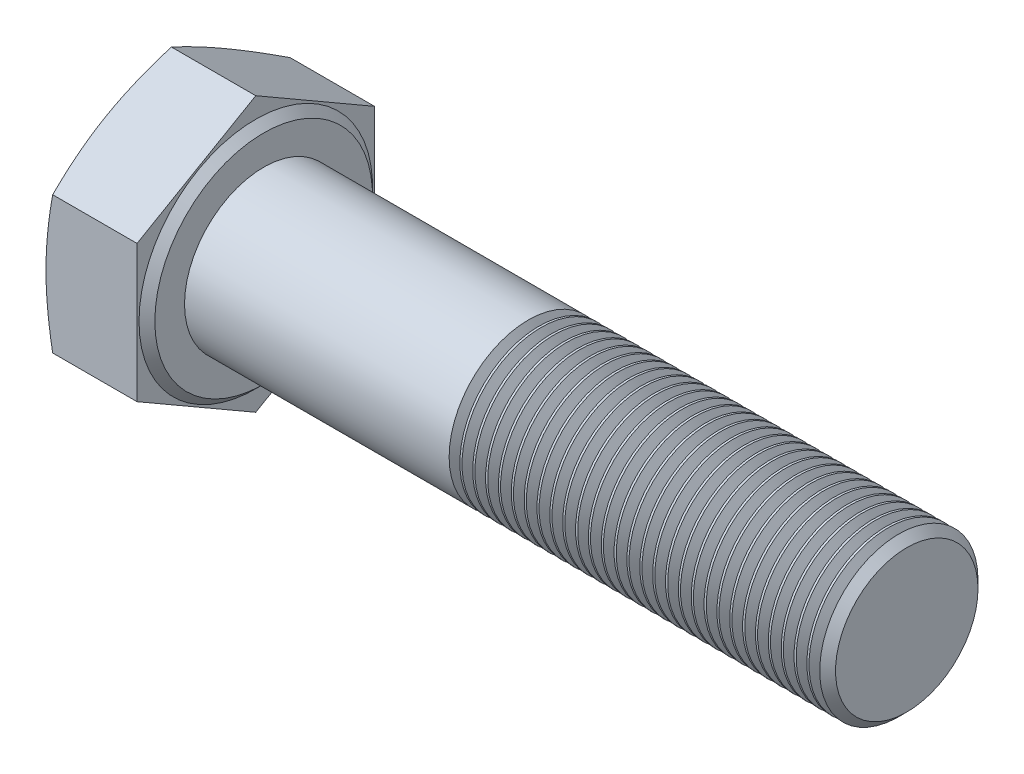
from build123d import *

# Parameters (mm, degrees)
BASEHEAD_DEPTH   = 10
SKETCH5_R        = 8
BASEBODY_DEPTH   = 65
CHAMFER1_SIZE    = 0.8
LPATTERN10_COUNT = 29
LPATTERN10_PITCH = 1.299


with BuildPart() as part:
    # Sketch2 → BaseHead (new body)
    with BuildSketch(Plane(origin=(0, 0, 0), x_dir=(0, 0, -1), z_dir=(1, 0, 0))):
        Polygon((0, -13.856406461), (12, -6.92820323), (12, 6.92820323), (0, 13.856406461), (-12, 6.92820323), (-12, -6.92820323), align=None)
    extrude(amount=BASEHEAD_DEPTH)

    # Sketch3 → BearingFace (revolve, cut)
    with BuildSketch(Plane.XY, mode=Mode.PRIVATE) as bearingface_sk:
        Polygon((10, 13.856406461), (10, 11), (9.2, 11.8), (9.2, 13.856406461), align=None)
    revolve(bearingface_sk.sketch.rotate(Axis((-0.957090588, 0, 0), (1, 0, 0)), 90), axis=Axis((-0.957090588, 0, 0), (1, 0, 0)), mode=Mode.SUBTRACT)

    # Sketch4 → HeadChamfer (revolve, cut)
    with BuildSketch(Plane.XY):
        Polygon((0, 13.856406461), (0.675676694, 13.856406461), (0, 12), align=None)
    revolve(axis=Axis((-0.493528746, 0, 0), (1, 0, 0)), mode=Mode.SUBTRACT)

    # Sketch5 → BaseBody (add)
    with BuildSketch(Plane(origin=(10, 0, 0), x_dir=(0, 0, -1), z_dir=(1, 0, 0))):
        with Locations(Location((0, 0, 0), (0, 0, 180))):
            Circle(SKETCH5_R)
    extrude(amount=BASEBODY_DEPTH)

    # Chamfer1
    chamfer1_edges = [part.edges().sort_by_distance(p)[0] for p in [
        (75, 0, -8),
    ]]
    chamfer(chamfer1_edges, length=CHAMFER1_SIZE)

    # Sketch6 → Cut-Revolve10 (revolve, cut)
    with BuildSketch(Plane.XY, mode=Mode.PRIVATE) as cut_revolve10_sk:
        Polygon((73.1175, 9.0825), (74.2, 9.0825), (74.2, 8), (73.65875, 7.0625275), (73.1175, 8), align=None)
    cut_revolve10 = revolve(cut_revolve10_sk.sketch.rotate(Axis((75, 0, 0), (-1, 0, 0)), 90), axis=Axis((75, 0, 0), (-1, 0, 0)), mode=Mode.SUBTRACT)

    # LPattern10: Cut-Revolve10 ×29
    with Locations(*[(-i * LPATTERN10_PITCH, 0, 0) for i in range(1, LPATTERN10_COUNT)]):
        add(cut_revolve10, mode=Mode.SUBTRACT)


solid = part.part
